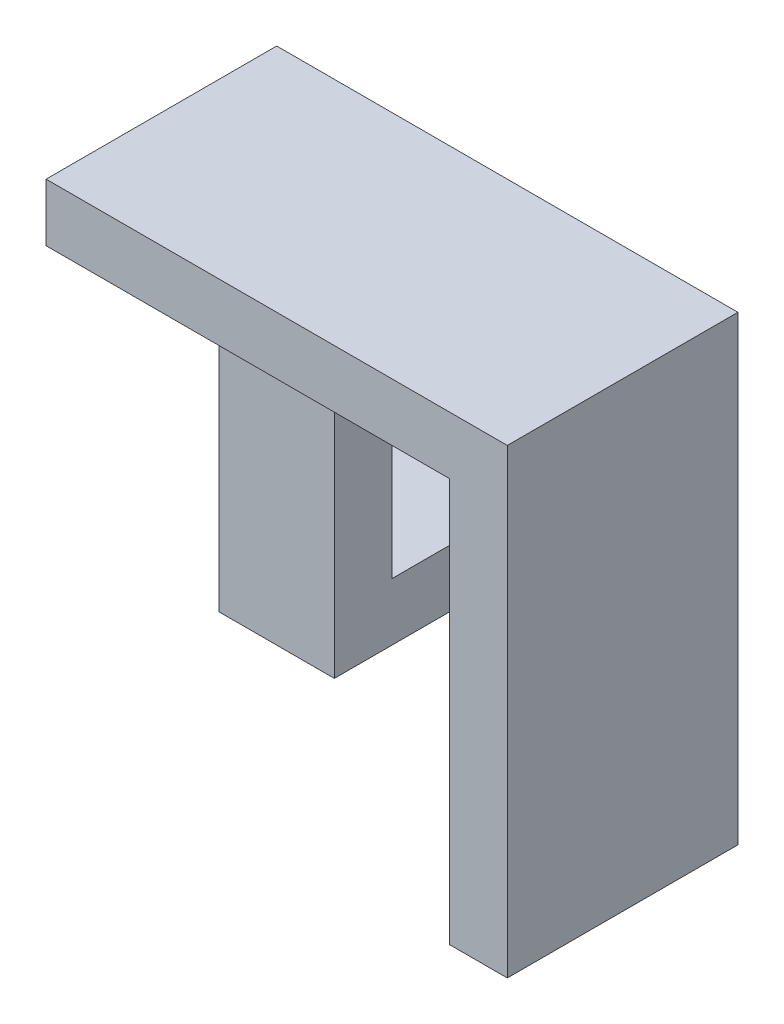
ISO-10303-21;
HEADER;
FILE_DESCRIPTION(('STEP AP214'),'2;1');
FILE_NAME('part.step','',(''),(''),'','','');
FILE_SCHEMA(('AUTOMOTIVE_DESIGN { 1 0 10303 214 1 1 1 1 }'));
ENDSEC;
DATA;
#1=APPLICATION_CONTEXT('core data for automotive mechanical design processes');
#2=APPLICATION_PROTOCOL_DEFINITION('international standard','automotive_design',2000,#1);
#3=PRODUCT_CONTEXT('',#1,'mechanical');
#4=PRODUCT('Part','Part','',(#3));
#5=PRODUCT_RELATED_PRODUCT_CATEGORY('part','',(#4));
#6=PRODUCT_DEFINITION_FORMATION('','',#4);
#7=PRODUCT_DEFINITION_CONTEXT('part definition',#1,'design');
#8=PRODUCT_DEFINITION('design','',#6,#7);
#9=PRODUCT_DEFINITION_SHAPE('','',#8);
#10=(LENGTH_UNIT() NAMED_UNIT(*) SI_UNIT(.MILLI.,.METRE.));
#11=(NAMED_UNIT(*) PLANE_ANGLE_UNIT() SI_UNIT($,.RADIAN.));
#12=(NAMED_UNIT(*) SI_UNIT($,.STERADIAN.) SOLID_ANGLE_UNIT());
#13=UNCERTAINTY_MEASURE_WITH_UNIT(LENGTH_MEASURE(1.E-05),#10,'distance_accuracy_value','');
#14=(GEOMETRIC_REPRESENTATION_CONTEXT(3) GLOBAL_UNCERTAINTY_ASSIGNED_CONTEXT((#13)) GLOBAL_UNIT_ASSIGNED_CONTEXT((#10,
#11,#12)) REPRESENTATION_CONTEXT('',''));
#15=CARTESIAN_POINT('',(0.,0.,0.));
#16=DIRECTION('',(0.,0.,1.));
#17=DIRECTION('',(1.,0.,0.));
#18=AXIS2_PLACEMENT_3D('',#15,#16,#17);
#19=CARTESIAN_POINT('',(0.,0.,-35.));
#20=DIRECTION('',(0.,0.,1.));
#21=DIRECTION('',(1.,0.,0.));
#22=AXIS2_PLACEMENT_3D('',#19,#20,#21);
#23=PLANE('',#22);
#24=DIRECTION('',(0.,-1.,0.));
#25=VECTOR('',#24,1.);
#26=CARTESIAN_POINT('',(-40.,40.,-35.));
#27=LINE('',#26,#25);
#28=CARTESIAN_POINT('',(-40.,-30.,-35.));
#29=VERTEX_POINT('',#28);
#30=CARTESIAN_POINT('',(-40.,-40.,-35.));
#31=VERTEX_POINT('',#30);
#32=EDGE_CURVE('E69',#29,#31,#27,.T.);
#33=ORIENTED_EDGE('',*,*,#32,.F.);
#34=DIRECTION('',(-1.,0.,0.));
#35=VECTOR('',#34,1.);
#36=CARTESIAN_POINT('',(40.,-30.,-35.));
#37=LINE('',#36,#35);
#38=CARTESIAN_POINT('',(-20.,-30.,-35.));
#39=VERTEX_POINT('',#38);
#40=EDGE_CURVE('E178',#39,#29,#37,.T.);
#41=ORIENTED_EDGE('',*,*,#40,.F.);
#42=DIRECTION('',(0.,-1.,0.));
#43=VECTOR('',#42,1.);
#44=CARTESIAN_POINT('',(-20.,30.,-35.));
#45=LINE('',#44,#43);
#46=CARTESIAN_POINT('',(-20.,-40.,-35.));
#47=VERTEX_POINT('',#46);
#48=EDGE_CURVE('E79',#39,#47,#45,.T.);
#49=ORIENTED_EDGE('',*,*,#48,.T.);
#50=DIRECTION('',(1.,0.,0.));
#51=VECTOR('',#50,1.);
#52=CARTESIAN_POINT('',(-40.,-40.,-35.));
#53=LINE('',#52,#51);
#54=EDGE_CURVE('E160',#31,#47,#53,.T.);
#55=ORIENTED_EDGE('',*,*,#54,.F.);
#56=EDGE_LOOP('',(#33,#41,#49,#55));
#57=FACE_BOUND('',#56,.T.);
#58=ADVANCED_FACE('F33',(#57),#23,.F.);
#59=CARTESIAN_POINT('',(-40.,-40.,35.));
#60=DIRECTION('',(0.,1.,0.));
#61=DIRECTION('',(0.,0.,1.));
#62=AXIS2_PLACEMENT_3D('',#59,#60,#61);
#63=PLANE('',#62);
#64=DIRECTION('',(0.,0.,1.));
#65=VECTOR('',#64,1.);
#66=CARTESIAN_POINT('',(-20.,-40.,-35.));
#67=LINE('',#66,#65);
#68=CARTESIAN_POINT('',(-20.,-40.,5.));
#69=VERTEX_POINT('',#68);
#70=EDGE_CURVE('E150',#47,#69,#67,.T.);
#71=ORIENTED_EDGE('',*,*,#70,.T.);
#72=DIRECTION('',(-1.,0.,0.));
#73=VECTOR('',#72,1.);
#74=CARTESIAN_POINT('',(106.157731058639,-40.,5.));
#75=LINE('',#74,#73);
#76=CARTESIAN_POINT('',(-40.,-40.,5.));
#77=VERTEX_POINT('',#76);
#78=EDGE_CURVE('E48',#69,#77,#75,.T.);
#79=ORIENTED_EDGE('',*,*,#78,.T.);
#80=DIRECTION('',(0.,0.,-1.));
#81=VECTOR('',#80,1.);
#82=CARTESIAN_POINT('',(-40.,-40.,35.));
#83=LINE('',#82,#81);
#84=EDGE_CURVE('E41',#77,#31,#83,.T.);
#85=ORIENTED_EDGE('',*,*,#84,.T.);
#86=ORIENTED_EDGE('',*,*,#54,.T.);
#87=EDGE_LOOP('',(#71,#79,#85,#86));
#88=FACE_BOUND('',#87,.T.);
#89=ADVANCED_FACE('F176',(#88),#63,.F.);
#90=CARTESIAN_POINT('',(-40.,40.,35.));
#91=DIRECTION('',(1.,0.,0.));
#92=DIRECTION('',(0.,1.,0.));
#93=AXIS2_PLACEMENT_3D('',#90,#91,#92);
#94=PLANE('',#93);
#95=DIRECTION('',(0.,0.,-1.));
#96=VECTOR('',#95,1.);
#97=CARTESIAN_POINT('',(-40.,40.,35.));
#98=LINE('',#97,#96);
#99=CARTESIAN_POINT('',(-40.,40.,35.));
#100=VERTEX_POINT('',#99);
#101=CARTESIAN_POINT('',(-40.,40.,-5.));
#102=VERTEX_POINT('',#101);
#103=EDGE_CURVE('E165',#100,#102,#98,.T.);
#104=ORIENTED_EDGE('',*,*,#103,.T.);
#105=DIRECTION('',(0.,1.,0.));
#106=VECTOR('',#105,1.);
#107=CARTESIAN_POINT('',(-40.,40.,-5.));
#108=LINE('',#107,#106);
#109=CARTESIAN_POINT('',(-40.,-30.,-5.));
#110=VERTEX_POINT('',#109);
#111=EDGE_CURVE('E222',#110,#102,#108,.T.);
#112=ORIENTED_EDGE('',*,*,#111,.F.);
#113=DIRECTION('',(0.,0.,1.));
#114=VECTOR('',#113,1.);
#115=CARTESIAN_POINT('',(-40.,-30.,-35.));
#116=LINE('',#115,#114);
#117=EDGE_CURVE('E145',#29,#110,#116,.T.);
#118=ORIENTED_EDGE('',*,*,#117,.F.);
#119=ORIENTED_EDGE('',*,*,#32,.T.);
#120=ORIENTED_EDGE('',*,*,#84,.F.);
#121=DIRECTION('',(0.,-1.,0.));
#122=VECTOR('',#121,1.);
#123=CARTESIAN_POINT('',(-40.,-40.,5.));
#124=LINE('',#123,#122);
#125=CARTESIAN_POINT('',(-40.,30.,5.));
#126=VERTEX_POINT('',#125);
#127=EDGE_CURVE('E205',#126,#77,#124,.T.);
#128=ORIENTED_EDGE('',*,*,#127,.F.);
#129=DIRECTION('',(0.,0.,-1.));
#130=VECTOR('',#129,1.);
#131=CARTESIAN_POINT('',(-40.,30.,35.));
#132=LINE('',#131,#130);
#133=CARTESIAN_POINT('',(-40.,30.,35.));
#134=VERTEX_POINT('',#133);
#135=EDGE_CURVE('E204',#134,#126,#132,.T.);
#136=ORIENTED_EDGE('',*,*,#135,.F.);
#137=DIRECTION('',(0.,-1.,0.));
#138=VECTOR('',#137,1.);
#139=CARTESIAN_POINT('',(-40.,40.,35.));
#140=LINE('',#139,#138);
#141=EDGE_CURVE('E158',#100,#134,#140,.T.);
#142=ORIENTED_EDGE('',*,*,#141,.F.);
#143=EDGE_LOOP('',(#104,#112,#118,#119,#120,#128,#136,#142));
#144=FACE_BOUND('',#143,.T.);
#145=ADVANCED_FACE('F35',(#144),#94,.F.);
#146=DIRECTION('',(0.,0.,1.));
#147=VECTOR('',#146,1.);
#148=CARTESIAN_POINT('',(30.,-40.,-35.));
#149=LINE('',#148,#147);
#150=CARTESIAN_POINT('',(30.,-40.,-5.));
#151=VERTEX_POINT('',#150);
#152=CARTESIAN_POINT('',(30.,-40.,35.));
#153=VERTEX_POINT('',#152);
#154=EDGE_CURVE('E132',#151,#153,#149,.T.);
#155=ORIENTED_EDGE('',*,*,#154,.F.);
#156=DIRECTION('',(1.,0.,0.));
#157=VECTOR('',#156,1.);
#158=CARTESIAN_POINT('',(30.,-40.,-5.));
#159=LINE('',#158,#157);
#160=CARTESIAN_POINT('',(40.,-40.,-5.));
#161=VERTEX_POINT('',#160);
#162=EDGE_CURVE('E138',#151,#161,#159,.T.);
#163=ORIENTED_EDGE('',*,*,#162,.T.);
#164=DIRECTION('',(0.,0.,-1.));
#165=VECTOR('',#164,1.);
#166=CARTESIAN_POINT('',(40.,-40.,35.));
#167=LINE('',#166,#165);
#168=CARTESIAN_POINT('',(40.,-40.,35.));
#169=VERTEX_POINT('',#168);
#170=EDGE_CURVE('E174',#169,#161,#167,.T.);
#171=ORIENTED_EDGE('',*,*,#170,.F.);
#172=DIRECTION('',(1.,0.,0.));
#173=VECTOR('',#172,1.);
#174=CARTESIAN_POINT('',(-40.,-40.,35.));
#175=LINE('',#174,#173);
#176=EDGE_CURVE('E149',#153,#169,#175,.T.);
#177=ORIENTED_EDGE('',*,*,#176,.F.);
#178=EDGE_LOOP('',(#155,#163,#171,#177));
#179=FACE_BOUND('',#178,.T.);
#180=ADVANCED_FACE('F148',(#179),#63,.F.);
#181=CARTESIAN_POINT('',(40.,40.,35.));
#182=DIRECTION('',(-1.,0.,0.));
#183=DIRECTION('',(0.,-1.,0.));
#184=AXIS2_PLACEMENT_3D('',#181,#182,#183);
#185=PLANE('',#184);
#186=ORIENTED_EDGE('',*,*,#170,.T.);
#187=DIRECTION('',(0.,1.,0.));
#188=VECTOR('',#187,1.);
#189=CARTESIAN_POINT('',(40.,40.,-5.));
#190=LINE('',#189,#188);
#191=CARTESIAN_POINT('',(40.,40.,-5.));
#192=VERTEX_POINT('',#191);
#193=EDGE_CURVE('E141',#161,#192,#190,.T.);
#194=ORIENTED_EDGE('',*,*,#193,.T.);
#195=DIRECTION('',(0.,0.,-1.));
#196=VECTOR('',#195,1.);
#197=CARTESIAN_POINT('',(40.,40.,35.));
#198=LINE('',#197,#196);
#199=CARTESIAN_POINT('',(40.,40.,35.));
#200=VERTEX_POINT('',#199);
#201=EDGE_CURVE('E171',#200,#192,#198,.T.);
#202=ORIENTED_EDGE('',*,*,#201,.F.);
#203=DIRECTION('',(0.,1.,0.));
#204=VECTOR('',#203,1.);
#205=CARTESIAN_POINT('',(40.,40.,35.));
#206=LINE('',#205,#204);
#207=EDGE_CURVE('E162',#169,#200,#206,.T.);
#208=ORIENTED_EDGE('',*,*,#207,.F.);
#209=EDGE_LOOP('',(#186,#194,#202,#208));
#210=FACE_BOUND('',#209,.T.);
#211=ADVANCED_FACE('F227',(#210),#185,.F.);
#212=CARTESIAN_POINT('',(-40.,40.,35.));
#213=DIRECTION('',(0.,-1.,0.));
#214=DIRECTION('',(0.,0.,-1.));
#215=AXIS2_PLACEMENT_3D('',#212,#213,#214);
#216=PLANE('',#215);
#217=ORIENTED_EDGE('',*,*,#201,.T.);
#218=DIRECTION('',(-1.,0.,0.));
#219=VECTOR('',#218,1.);
#220=CARTESIAN_POINT('',(40.,40.,-5.));
#221=LINE('',#220,#219);
#222=EDGE_CURVE('E217',#192,#102,#221,.T.);
#223=ORIENTED_EDGE('',*,*,#222,.T.);
#224=ORIENTED_EDGE('',*,*,#103,.F.);
#225=DIRECTION('',(-1.,0.,0.));
#226=VECTOR('',#225,1.);
#227=CARTESIAN_POINT('',(-40.,40.,35.));
#228=LINE('',#227,#226);
#229=EDGE_CURVE('E57',#200,#100,#228,.T.);
#230=ORIENTED_EDGE('',*,*,#229,.F.);
#231=EDGE_LOOP('',(#217,#223,#224,#230));
#232=FACE_BOUND('',#231,.T.);
#233=ADVANCED_FACE('F230',(#232),#216,.F.);
#234=CARTESIAN_POINT('',(0.,0.,35.));
#235=DIRECTION('',(0.,0.,1.));
#236=DIRECTION('',(1.,0.,0.));
#237=AXIS2_PLACEMENT_3D('',#234,#235,#236);
#238=PLANE('',#237);
#239=ORIENTED_EDGE('',*,*,#141,.T.);
#240=DIRECTION('',(-1.,0.,0.));
#241=VECTOR('',#240,1.);
#242=CARTESIAN_POINT('',(-20.,30.,35.));
#243=LINE('',#242,#241);
#244=CARTESIAN_POINT('',(30.,30.,35.));
#245=VERTEX_POINT('',#244);
#246=EDGE_CURVE('E188',#245,#134,#243,.T.);
#247=ORIENTED_EDGE('',*,*,#246,.F.);
#248=DIRECTION('',(0.,1.,0.));
#249=VECTOR('',#248,1.);
#250=CARTESIAN_POINT('',(30.,30.,35.));
#251=LINE('',#250,#249);
#252=EDGE_CURVE('E190',#153,#245,#251,.T.);
#253=ORIENTED_EDGE('',*,*,#252,.F.);
#254=ORIENTED_EDGE('',*,*,#176,.T.);
#255=ORIENTED_EDGE('',*,*,#207,.T.);
#256=ORIENTED_EDGE('',*,*,#229,.T.);
#257=EDGE_LOOP('',(#239,#247,#253,#254,#255,#256));
#258=FACE_BOUND('',#257,.T.);
#259=ADVANCED_FACE('F211',(#258),#238,.T.);
#260=CARTESIAN_POINT('',(-20.,30.,-35.));
#261=DIRECTION('',(-1.,0.,0.));
#262=DIRECTION('',(0.,-1.,0.));
#263=AXIS2_PLACEMENT_3D('',#260,#261,#262);
#264=PLANE('',#263);
#265=DIRECTION('',(0.,0.,1.));
#266=VECTOR('',#265,1.);
#267=CARTESIAN_POINT('',(-20.,-30.,-35.));
#268=LINE('',#267,#266);
#269=CARTESIAN_POINT('',(-20.,-30.,-5.));
#270=VERTEX_POINT('',#269);
#271=EDGE_CURVE('E187',#39,#270,#268,.T.);
#272=ORIENTED_EDGE('',*,*,#271,.T.);
#273=DIRECTION('',(0.,1.,0.));
#274=VECTOR('',#273,1.);
#275=CARTESIAN_POINT('',(-20.,30.,-5.));
#276=LINE('',#275,#274);
#277=CARTESIAN_POINT('',(-20.,30.,-5.));
#278=VERTEX_POINT('',#277);
#279=EDGE_CURVE('E195',#270,#278,#276,.T.);
#280=ORIENTED_EDGE('',*,*,#279,.T.);
#281=DIRECTION('',(0.,0.,1.));
#282=VECTOR('',#281,1.);
#283=CARTESIAN_POINT('',(-20.,30.,-35.));
#284=LINE('',#283,#282);
#285=CARTESIAN_POINT('',(-20.,30.,5.));
#286=VERTEX_POINT('',#285);
#287=EDGE_CURVE('E152',#278,#286,#284,.T.);
#288=ORIENTED_EDGE('',*,*,#287,.T.);
#289=DIRECTION('',(0.,-1.,0.));
#290=VECTOR('',#289,1.);
#291=CARTESIAN_POINT('',(-20.,30.,5.));
#292=LINE('',#291,#290);
#293=EDGE_CURVE('E194',#286,#69,#292,.T.);
#294=ORIENTED_EDGE('',*,*,#293,.T.);
#295=ORIENTED_EDGE('',*,*,#70,.F.);
#296=ORIENTED_EDGE('',*,*,#48,.F.);
#297=EDGE_LOOP('',(#272,#280,#288,#294,#295,#296));
#298=FACE_BOUND('',#297,.T.);
#299=ADVANCED_FACE('F185',(#298),#264,.F.);
#300=CARTESIAN_POINT('',(-20.,30.,-35.));
#301=DIRECTION('',(0.,1.,0.));
#302=DIRECTION('',(0.,0.,1.));
#303=AXIS2_PLACEMENT_3D('',#300,#301,#302);
#304=PLANE('',#303);
#305=ORIENTED_EDGE('',*,*,#287,.F.);
#306=DIRECTION('',(1.,0.,0.));
#307=VECTOR('',#306,1.);
#308=CARTESIAN_POINT('',(-20.,30.,-5.));
#309=LINE('',#308,#307);
#310=CARTESIAN_POINT('',(30.,30.,-5.));
#311=VERTEX_POINT('',#310);
#312=EDGE_CURVE('E213',#278,#311,#309,.T.);
#313=ORIENTED_EDGE('',*,*,#312,.T.);
#314=DIRECTION('',(0.,0.,1.));
#315=VECTOR('',#314,1.);
#316=CARTESIAN_POINT('',(30.,30.,-35.));
#317=LINE('',#316,#315);
#318=EDGE_CURVE('E134',#311,#245,#317,.T.);
#319=ORIENTED_EDGE('',*,*,#318,.T.);
#320=ORIENTED_EDGE('',*,*,#246,.T.);
#321=ORIENTED_EDGE('',*,*,#135,.T.);
#322=DIRECTION('',(-1.,0.,0.));
#323=VECTOR('',#322,1.);
#324=CARTESIAN_POINT('',(106.157731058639,30.,5.));
#325=LINE('',#324,#323);
#326=EDGE_CURVE('E199',#286,#126,#325,.T.);
#327=ORIENTED_EDGE('',*,*,#326,.F.);
#328=EDGE_LOOP('',(#305,#313,#319,#320,#321,#327));
#329=FACE_BOUND('',#328,.T.);
#330=ADVANCED_FACE('F202',(#329),#304,.F.);
#331=CARTESIAN_POINT('',(30.,30.,-35.));
#332=DIRECTION('',(1.,0.,0.));
#333=DIRECTION('',(0.,1.,0.));
#334=AXIS2_PLACEMENT_3D('',#331,#332,#333);
#335=PLANE('',#334);
#336=DIRECTION('',(0.,-1.,0.));
#337=VECTOR('',#336,1.);
#338=CARTESIAN_POINT('',(30.,30.,-5.));
#339=LINE('',#338,#337);
#340=EDGE_CURVE('E11',#311,#151,#339,.T.);
#341=ORIENTED_EDGE('',*,*,#340,.T.);
#342=ORIENTED_EDGE('',*,*,#154,.T.);
#343=ORIENTED_EDGE('',*,*,#252,.T.);
#344=ORIENTED_EDGE('',*,*,#318,.F.);
#345=EDGE_LOOP('',(#341,#342,#343,#344));
#346=FACE_BOUND('',#345,.T.);
#347=ADVANCED_FACE('F129',(#346),#335,.F.);
#348=CARTESIAN_POINT('',(106.157731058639,-40.,5.));
#349=DIRECTION('',(0.,0.,-1.));
#350=DIRECTION('',(-1.,0.,0.));
#351=AXIS2_PLACEMENT_3D('',#348,#349,#350);
#352=PLANE('',#351);
#353=ORIENTED_EDGE('',*,*,#326,.T.);
#354=ORIENTED_EDGE('',*,*,#127,.T.);
#355=ORIENTED_EDGE('',*,*,#78,.F.);
#356=ORIENTED_EDGE('',*,*,#293,.F.);
#357=EDGE_LOOP('',(#353,#354,#355,#356));
#358=FACE_BOUND('',#357,.T.);
#359=ADVANCED_FACE('F198',(#358),#352,.F.);
#360=CARTESIAN_POINT('',(40.,40.,-5.));
#361=DIRECTION('',(0.,0.,1.));
#362=DIRECTION('',(0.,-1.,0.));
#363=AXIS2_PLACEMENT_3D('',#360,#361,#362);
#364=PLANE('',#363);
#365=DIRECTION('',(-1.,0.,0.));
#366=VECTOR('',#365,1.);
#367=CARTESIAN_POINT('',(40.,-30.,-5.));
#368=LINE('',#367,#366);
#369=EDGE_CURVE('E181',#270,#110,#368,.T.);
#370=ORIENTED_EDGE('',*,*,#369,.T.);
#371=ORIENTED_EDGE('',*,*,#111,.T.);
#372=ORIENTED_EDGE('',*,*,#222,.F.);
#373=ORIENTED_EDGE('',*,*,#193,.F.);
#374=ORIENTED_EDGE('',*,*,#162,.F.);
#375=ORIENTED_EDGE('',*,*,#340,.F.);
#376=ORIENTED_EDGE('',*,*,#312,.F.);
#377=ORIENTED_EDGE('',*,*,#279,.F.);
#378=EDGE_LOOP('',(#370,#371,#372,#373,#374,#375,#376,#377));
#379=FACE_BOUND('',#378,.T.);
#380=ADVANCED_FACE('F139',(#379),#364,.F.);
#381=CARTESIAN_POINT('',(40.,-30.,-35.));
#382=DIRECTION('',(0.,-1.,0.));
#383=DIRECTION('',(1.,0.,0.));
#384=AXIS2_PLACEMENT_3D('',#381,#382,#383);
#385=PLANE('',#384);
#386=ORIENTED_EDGE('',*,*,#40,.T.);
#387=ORIENTED_EDGE('',*,*,#117,.T.);
#388=ORIENTED_EDGE('',*,*,#369,.F.);
#389=ORIENTED_EDGE('',*,*,#271,.F.);
#390=EDGE_LOOP('',(#386,#387,#388,#389));
#391=FACE_BOUND('',#390,.T.);
#392=ADVANCED_FACE('F233',(#391),#385,.F.);
#393=CLOSED_SHELL('',(#58,#89,#145,#180,#211,#233,#259,#299,#330,#347,#359,#380,#392));
#394=MANIFOLD_SOLID_BREP('B2',#393);
#395=ADVANCED_BREP_SHAPE_REPRESENTATION('',(#18,#394),#14);
#396=SHAPE_DEFINITION_REPRESENTATION(#9,#395);
ENDSEC;
END-ISO-10303-21;
